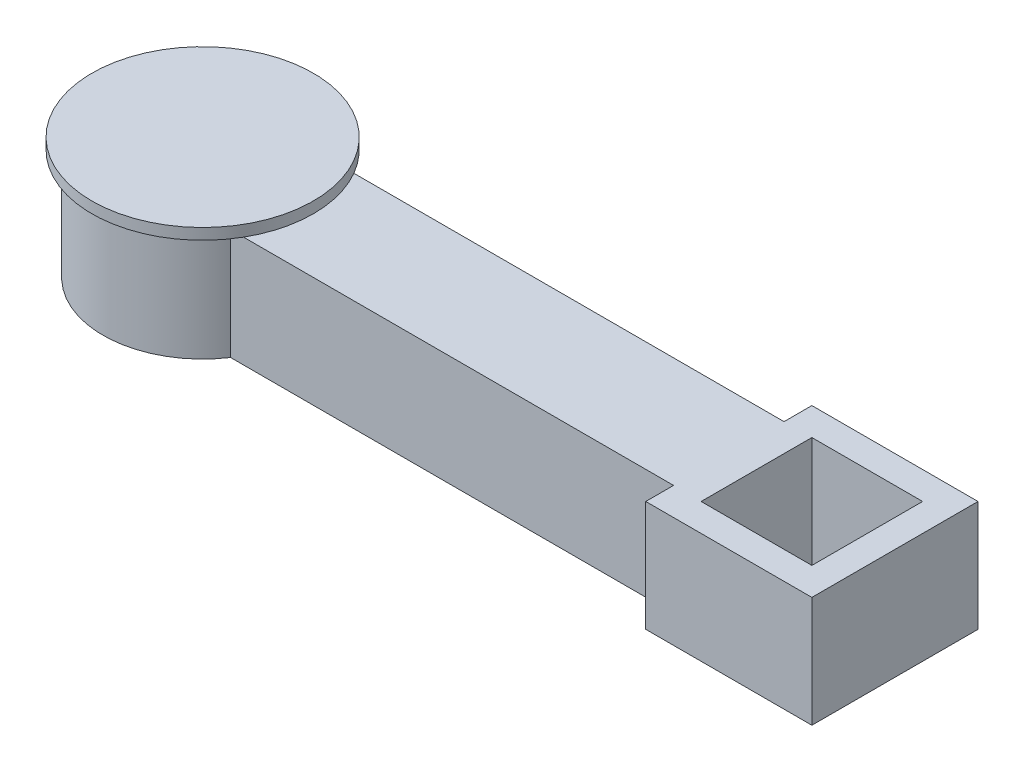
ISO-10303-21;
HEADER;
FILE_DESCRIPTION(('STEP AP214'),'2;1');
FILE_NAME('part.step','',(''),(''),'','','');
FILE_SCHEMA(('AUTOMOTIVE_DESIGN { 1 0 10303 214 1 1 1 1 }'));
ENDSEC;
DATA;
#1=APPLICATION_CONTEXT('core data for automotive mechanical design processes');
#2=APPLICATION_PROTOCOL_DEFINITION('international standard','automotive_design',2000,#1);
#3=PRODUCT_CONTEXT('',#1,'mechanical');
#4=PRODUCT('Part','Part','',(#3));
#5=PRODUCT_RELATED_PRODUCT_CATEGORY('part','',(#4));
#6=PRODUCT_DEFINITION_FORMATION('','',#4);
#7=PRODUCT_DEFINITION_CONTEXT('part definition',#1,'design');
#8=PRODUCT_DEFINITION('design','',#6,#7);
#9=PRODUCT_DEFINITION_SHAPE('','',#8);
#10=(LENGTH_UNIT() NAMED_UNIT(*) SI_UNIT(.MILLI.,.METRE.));
#11=(NAMED_UNIT(*) PLANE_ANGLE_UNIT() SI_UNIT($,.RADIAN.));
#12=(NAMED_UNIT(*) SI_UNIT($,.STERADIAN.) SOLID_ANGLE_UNIT());
#13=UNCERTAINTY_MEASURE_WITH_UNIT(LENGTH_MEASURE(1.E-05),#10,'distance_accuracy_value','');
#14=(GEOMETRIC_REPRESENTATION_CONTEXT(3) GLOBAL_UNCERTAINTY_ASSIGNED_CONTEXT((#13)) GLOBAL_UNIT_ASSIGNED_CONTEXT((#10,
#11,#12)) REPRESENTATION_CONTEXT('',''));
#15=CARTESIAN_POINT('',(0.,0.,0.));
#16=DIRECTION('',(0.,0.,1.));
#17=DIRECTION('',(1.,0.,0.));
#18=AXIS2_PLACEMENT_3D('',#15,#16,#17);
#19=CARTESIAN_POINT('',(163.145565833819,100.,-1.80674005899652E-11));
#20=DIRECTION('',(-1.,0.,1.10744049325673E-13));
#21=DIRECTION('',(1.10744049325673E-13,0.,1.));
#22=AXIS2_PLACEMENT_3D('',#19,#20,#21);
#23=PLANE('',#22);
#24=DIRECTION('',(-1.10744049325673E-13,0.,-1.));
#25=VECTOR('',#24,1.);
#26=CARTESIAN_POINT('',(163.145565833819,0.,-1.80674005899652E-11));
#27=LINE('',#26,#25);
#28=CARTESIAN_POINT('',(163.145565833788,0.,-275.741810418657));
#29=VERTEX_POINT('',#28);
#30=CARTESIAN_POINT('',(163.145565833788,0.,-275.992438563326));
#31=VERTEX_POINT('',#30);
#32=EDGE_CURVE('E235',#29,#31,#27,.T.);
#33=ORIENTED_EDGE('',*,*,#32,.F.);
#34=DIRECTION('',(0.,-1.,0.));
#35=VECTOR('',#34,1.);
#36=CARTESIAN_POINT('',(163.145565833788,100.,-275.741810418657));
#37=LINE('',#36,#35);
#38=CARTESIAN_POINT('',(163.145565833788,100.,-275.741810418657));
#39=VERTEX_POINT('',#38);
#40=EDGE_CURVE('E12',#39,#29,#37,.T.);
#41=ORIENTED_EDGE('',*,*,#40,.F.);
#42=DIRECTION('',(-1.10744049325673E-13,0.,-1.));
#43=VECTOR('',#42,1.);
#44=CARTESIAN_POINT('',(163.145565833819,100.,-1.80674005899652E-11));
#45=LINE('',#44,#43);
#46=CARTESIAN_POINT('',(163.145565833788,100.,-275.992438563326));
#47=VERTEX_POINT('',#46);
#48=EDGE_CURVE('E220',#39,#47,#45,.T.);
#49=ORIENTED_EDGE('',*,*,#48,.T.);
#50=DIRECTION('',(0.,-1.,0.));
#51=VECTOR('',#50,1.);
#52=CARTESIAN_POINT('',(163.145565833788,100.,-275.992438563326));
#53=LINE('',#52,#51);
#54=EDGE_CURVE('E234',#47,#31,#53,.T.);
#55=ORIENTED_EDGE('',*,*,#54,.T.);
#56=EDGE_LOOP('',(#33,#41,#49,#55));
#57=FACE_BOUND('',#56,.T.);
#58=ADVANCED_FACE('F68',(#57),#23,.T.);
#59=CARTESIAN_POINT('',(88.145565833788,100.,-225.992438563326));
#60=DIRECTION('',(0.,-1.,0.));
#61=DIRECTION('',(0.,0.,-1.));
#62=AXIS2_PLACEMENT_3D('',#59,#60,#61);
#63=CYLINDRICAL_SURFACE('',#62,90.);
#64=CARTESIAN_POINT('',(88.145565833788,0.,-225.992438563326));
#65=DIRECTION('',(0.,1.,0.));
#66=DIRECTION('',(0.,0.,1.));
#67=AXIS2_PLACEMENT_3D('',#64,#65,#66);
#68=CIRCLE('',#67,90.);
#69=CARTESIAN_POINT('',(163.145565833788,0.,-176.243066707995));
#70=VERTEX_POINT('',#69);
#71=EDGE_CURVE('E238',#29,#70,#68,.T.);
#72=ORIENTED_EDGE('',*,*,#71,.T.);
#73=DIRECTION('',(0.,-1.,0.));
#74=VECTOR('',#73,1.);
#75=CARTESIAN_POINT('',(163.145565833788,100.,-176.243066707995));
#76=LINE('',#75,#74);
#77=CARTESIAN_POINT('',(163.145565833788,100.,-176.243066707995));
#78=VERTEX_POINT('',#77);
#79=EDGE_CURVE('E77',#78,#70,#76,.T.);
#80=ORIENTED_EDGE('',*,*,#79,.F.);
#81=CARTESIAN_POINT('',(88.145565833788,100.,-225.992438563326));
#82=DIRECTION('',(0.,1.,0.));
#83=DIRECTION('',(0.,0.,1.));
#84=AXIS2_PLACEMENT_3D('',#81,#82,#83);
#85=CIRCLE('',#84,90.);
#86=EDGE_CURVE('E223',#39,#78,#85,.T.);
#87=ORIENTED_EDGE('',*,*,#86,.F.);
#88=ORIENTED_EDGE('',*,*,#40,.T.);
#89=EDGE_LOOP('',(#72,#80,#87,#88));
#90=FACE_BOUND('',#89,.T.);
#91=ADVANCED_FACE('F316',(#90),#63,.T.);
#92=CARTESIAN_POINT('',(0.,100.,-176.243066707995));
#93=DIRECTION('',(0.,0.,-1.));
#94=DIRECTION('',(-1.,0.,0.));
#95=AXIS2_PLACEMENT_3D('',#92,#93,#94);
#96=PLANE('',#95);
#97=DIRECTION('',(1.,0.,0.));
#98=VECTOR('',#97,1.);
#99=CARTESIAN_POINT('',(0.,0.,-176.243066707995));
#100=LINE('',#99,#98);
#101=CARTESIAN_POINT('',(563.145565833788,0.,-176.243066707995));
#102=VERTEX_POINT('',#101);
#103=EDGE_CURVE('E240',#70,#102,#100,.T.);
#104=ORIENTED_EDGE('',*,*,#103,.T.);
#105=DIRECTION('',(0.,-1.,0.));
#106=VECTOR('',#105,1.);
#107=CARTESIAN_POINT('',(563.145565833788,100.,-176.243066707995));
#108=LINE('',#107,#106);
#109=CARTESIAN_POINT('',(563.145565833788,100.,-176.243066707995));
#110=VERTEX_POINT('',#109);
#111=EDGE_CURVE('E248',#110,#102,#108,.T.);
#112=ORIENTED_EDGE('',*,*,#111,.F.);
#113=DIRECTION('',(1.,0.,0.));
#114=VECTOR('',#113,1.);
#115=CARTESIAN_POINT('',(0.,100.,-176.243066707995));
#116=LINE('',#115,#114);
#117=CARTESIAN_POINT('',(174.892323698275,100.,-176.243066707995));
#118=VERTEX_POINT('',#117);
#119=EDGE_CURVE('E227',#118,#110,#116,.T.);
#120=ORIENTED_EDGE('',*,*,#119,.F.);
#121=EDGE_CURVE('E228',#78,#118,#116,.T.);
#122=ORIENTED_EDGE('',*,*,#121,.F.);
#123=ORIENTED_EDGE('',*,*,#79,.T.);
#124=EDGE_LOOP('',(#104,#112,#120,#122,#123));
#125=FACE_BOUND('',#124,.T.);
#126=ADVANCED_FACE('F312',(#125),#96,.F.);
#127=CARTESIAN_POINT('',(0.,100.,-275.992438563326));
#128=DIRECTION('',(0.,0.,-1.));
#129=DIRECTION('',(-1.,0.,0.));
#130=AXIS2_PLACEMENT_3D('',#127,#128,#129);
#131=PLANE('',#130);
#132=DIRECTION('',(1.,0.,0.));
#133=VECTOR('',#132,1.);
#134=CARTESIAN_POINT('',(0.,0.,-275.992438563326));
#135=LINE('',#134,#133);
#136=CARTESIAN_POINT('',(563.145565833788,0.,-275.992438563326));
#137=VERTEX_POINT('',#136);
#138=EDGE_CURVE('E224',#31,#137,#135,.T.);
#139=ORIENTED_EDGE('',*,*,#138,.F.);
#140=ORIENTED_EDGE('',*,*,#54,.F.);
#141=DIRECTION('',(1.,0.,0.));
#142=VECTOR('',#141,1.);
#143=CARTESIAN_POINT('',(0.,100.,-275.992438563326));
#144=LINE('',#143,#142);
#145=CARTESIAN_POINT('',(174.748106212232,100.,-275.992438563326));
#146=VERTEX_POINT('',#145);
#147=EDGE_CURVE('E232',#47,#146,#144,.T.);
#148=ORIENTED_EDGE('',*,*,#147,.T.);
#149=CARTESIAN_POINT('',(563.145565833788,100.,-275.992438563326));
#150=VERTEX_POINT('',#149);
#151=EDGE_CURVE('E231',#146,#150,#144,.T.);
#152=ORIENTED_EDGE('',*,*,#151,.T.);
#153=DIRECTION('',(0.,-1.,0.));
#154=VECTOR('',#153,1.);
#155=CARTESIAN_POINT('',(563.145565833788,100.,-275.992438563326));
#156=LINE('',#155,#154);
#157=EDGE_CURVE('E246',#150,#137,#156,.T.);
#158=ORIENTED_EDGE('',*,*,#157,.T.);
#159=EDGE_LOOP('',(#139,#140,#148,#152,#158));
#160=FACE_BOUND('',#159,.T.);
#161=ADVANCED_FACE('F323',(#160),#131,.T.);
#162=CARTESIAN_POINT('',(0.,100.,0.));
#163=DIRECTION('',(0.,1.,0.));
#164=DIRECTION('',(0.,0.,1.));
#165=AXIS2_PLACEMENT_3D('',#162,#163,#164);
#166=PLANE('',#165);
#167=DIRECTION('',(0.,0.,1.));
#168=VECTOR('',#167,1.);
#169=CARTESIAN_POINT('',(588.145565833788,100.,-176.117752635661));
#170=LINE('',#169,#168);
#171=CARTESIAN_POINT('',(588.145565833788,100.,-276.117752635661));
#172=VERTEX_POINT('',#171);
#173=CARTESIAN_POINT('',(588.145565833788,100.,-176.117752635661));
#174=VERTEX_POINT('',#173);
#175=EDGE_CURVE('E85',#172,#174,#170,.T.);
#176=ORIENTED_EDGE('',*,*,#175,.F.);
#177=DIRECTION('',(-1.,0.,0.));
#178=VECTOR('',#177,1.);
#179=CARTESIAN_POINT('',(588.145565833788,100.,-276.117752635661));
#180=LINE('',#179,#178);
#181=CARTESIAN_POINT('',(688.145565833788,100.,-276.117752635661));
#182=VERTEX_POINT('',#181);
#183=EDGE_CURVE('E188',#182,#172,#180,.T.);
#184=ORIENTED_EDGE('',*,*,#183,.F.);
#185=DIRECTION('',(0.,0.,-1.));
#186=VECTOR('',#185,1.);
#187=CARTESIAN_POINT('',(688.145565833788,100.,-176.117752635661));
#188=LINE('',#187,#186);
#189=CARTESIAN_POINT('',(688.145565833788,100.,-176.117752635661));
#190=VERTEX_POINT('',#189);
#191=EDGE_CURVE('E191',#190,#182,#188,.T.);
#192=ORIENTED_EDGE('',*,*,#191,.F.);
#193=DIRECTION('',(1.,0.,0.));
#194=VECTOR('',#193,1.);
#195=CARTESIAN_POINT('',(588.145565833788,100.,-176.117752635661));
#196=LINE('',#195,#194);
#197=EDGE_CURVE('E197',#174,#190,#196,.T.);
#198=ORIENTED_EDGE('',*,*,#197,.F.);
#199=EDGE_LOOP('',(#176,#184,#192,#198));
#200=FACE_BOUND('',#199,.T.);
#201=CARTESIAN_POINT('',(88.145565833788,100.,-225.992438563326));
#202=DIRECTION('',(0.,1.,0.));
#203=DIRECTION('',(0.,0.,1.));
#204=AXIS2_PLACEMENT_3D('',#201,#202,#203);
#205=CIRCLE('',#204,100.);
#206=EDGE_CURVE('E211',#118,#146,#205,.T.);
#207=ORIENTED_EDGE('',*,*,#206,.F.);
#208=ORIENTED_EDGE('',*,*,#119,.T.);
#209=DIRECTION('',(0.,0.,1.));
#210=VECTOR('',#209,1.);
#211=CARTESIAN_POINT('',(563.145565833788,100.,-301.117752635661));
#212=LINE('',#211,#210);
#213=CARTESIAN_POINT('',(563.145565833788,100.,-151.117752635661));
#214=VERTEX_POINT('',#213);
#215=EDGE_CURVE('E261',#110,#214,#212,.T.);
#216=ORIENTED_EDGE('',*,*,#215,.T.);
#217=DIRECTION('',(1.,0.,0.));
#218=VECTOR('',#217,1.);
#219=CARTESIAN_POINT('',(563.145565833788,100.,-151.117752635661));
#220=LINE('',#219,#218);
#221=CARTESIAN_POINT('',(713.145565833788,100.,-151.117752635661));
#222=VERTEX_POINT('',#221);
#223=EDGE_CURVE('E252',#214,#222,#220,.T.);
#224=ORIENTED_EDGE('',*,*,#223,.T.);
#225=DIRECTION('',(0.,0.,1.));
#226=VECTOR('',#225,1.);
#227=CARTESIAN_POINT('',(713.145565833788,100.,-301.117752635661));
#228=LINE('',#227,#226);
#229=CARTESIAN_POINT('',(713.145565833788,100.,-301.117752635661));
#230=VERTEX_POINT('',#229);
#231=EDGE_CURVE('E254',#230,#222,#228,.T.);
#232=ORIENTED_EDGE('',*,*,#231,.F.);
#233=DIRECTION('',(1.,0.,0.));
#234=VECTOR('',#233,1.);
#235=CARTESIAN_POINT('',(563.145565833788,100.,-301.117752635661));
#236=LINE('',#235,#234);
#237=CARTESIAN_POINT('',(563.145565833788,100.,-301.117752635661));
#238=VERTEX_POINT('',#237);
#239=EDGE_CURVE('E258',#238,#230,#236,.T.);
#240=ORIENTED_EDGE('',*,*,#239,.F.);
#241=EDGE_CURVE('E262',#238,#150,#212,.T.);
#242=ORIENTED_EDGE('',*,*,#241,.T.);
#243=ORIENTED_EDGE('',*,*,#151,.F.);
#244=EDGE_LOOP('',(#207,#208,#216,#224,#232,#240,#242,#243));
#245=FACE_BOUND('',#244,.T.);
#246=ADVANCED_FACE('F303',(#200,#245),#166,.T.);
#247=CARTESIAN_POINT('',(0.,0.,0.));
#248=DIRECTION('',(0.,1.,0.));
#249=DIRECTION('',(0.,0.,1.));
#250=AXIS2_PLACEMENT_3D('',#247,#248,#249);
#251=PLANE('',#250);
#252=DIRECTION('',(-1.,0.,0.));
#253=VECTOR('',#252,1.);
#254=CARTESIAN_POINT('',(588.145565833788,0.,-276.117752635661));
#255=LINE('',#254,#253);
#256=CARTESIAN_POINT('',(688.145565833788,0.,-276.117752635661));
#257=VERTEX_POINT('',#256);
#258=CARTESIAN_POINT('',(588.145565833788,0.,-276.117752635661));
#259=VERTEX_POINT('',#258);
#260=EDGE_CURVE('E178',#257,#259,#255,.T.);
#261=ORIENTED_EDGE('',*,*,#260,.T.);
#262=DIRECTION('',(0.,0.,1.));
#263=VECTOR('',#262,1.);
#264=CARTESIAN_POINT('',(588.145565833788,0.,-176.117752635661));
#265=LINE('',#264,#263);
#266=CARTESIAN_POINT('',(588.145565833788,0.,-176.117752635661));
#267=VERTEX_POINT('',#266);
#268=EDGE_CURVE('E172',#259,#267,#265,.T.);
#269=ORIENTED_EDGE('',*,*,#268,.T.);
#270=DIRECTION('',(1.,0.,0.));
#271=VECTOR('',#270,1.);
#272=CARTESIAN_POINT('',(588.145565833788,0.,-176.117752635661));
#273=LINE('',#272,#271);
#274=CARTESIAN_POINT('',(688.145565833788,0.,-176.117752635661));
#275=VERTEX_POINT('',#274);
#276=EDGE_CURVE('E181',#267,#275,#273,.T.);
#277=ORIENTED_EDGE('',*,*,#276,.T.);
#278=DIRECTION('',(0.,0.,-1.));
#279=VECTOR('',#278,1.);
#280=CARTESIAN_POINT('',(688.145565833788,0.,-176.117752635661));
#281=LINE('',#280,#279);
#282=EDGE_CURVE('E93',#275,#257,#281,.T.);
#283=ORIENTED_EDGE('',*,*,#282,.T.);
#284=EDGE_LOOP('',(#261,#269,#277,#283));
#285=FACE_BOUND('',#284,.T.);
#286=CARTESIAN_POINT('',(88.145565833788,0.,-225.992438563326));
#287=DIRECTION('',(0.,1.,0.));
#288=DIRECTION('',(0.,0.,1.));
#289=AXIS2_PLACEMENT_3D('',#286,#287,#288);
#290=CIRCLE('',#289,70.);
#291=CARTESIAN_POINT('',(88.145565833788,0.,-155.992438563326));
#292=VERTEX_POINT('',#291);
#293=EDGE_CURVE('E214',#292,#292,#290,.T.);
#294=ORIENTED_EDGE('',*,*,#293,.T.);
#295=EDGE_LOOP('',(#294));
#296=FACE_BOUND('',#295,.T.);
#297=ORIENTED_EDGE('',*,*,#32,.T.);
#298=ORIENTED_EDGE('',*,*,#138,.T.);
#299=DIRECTION('',(0.,0.,1.));
#300=VECTOR('',#299,1.);
#301=CARTESIAN_POINT('',(563.145565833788,0.,-301.117752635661));
#302=LINE('',#301,#300);
#303=CARTESIAN_POINT('',(563.145565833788,0.,-301.117752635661));
#304=VERTEX_POINT('',#303);
#305=EDGE_CURVE('E255',#304,#137,#302,.T.);
#306=ORIENTED_EDGE('',*,*,#305,.F.);
#307=DIRECTION('',(1.,0.,0.));
#308=VECTOR('',#307,1.);
#309=CARTESIAN_POINT('',(563.145565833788,0.,-301.117752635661));
#310=LINE('',#309,#308);
#311=CARTESIAN_POINT('',(713.145565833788,0.,-301.117752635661));
#312=VERTEX_POINT('',#311);
#313=EDGE_CURVE('E271',#304,#312,#310,.T.);
#314=ORIENTED_EDGE('',*,*,#313,.T.);
#315=DIRECTION('',(0.,0.,1.));
#316=VECTOR('',#315,1.);
#317=CARTESIAN_POINT('',(713.145565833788,0.,-301.117752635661));
#318=LINE('',#317,#316);
#319=CARTESIAN_POINT('',(713.145565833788,0.,-151.117752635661));
#320=VERTEX_POINT('',#319);
#321=EDGE_CURVE('E268',#312,#320,#318,.T.);
#322=ORIENTED_EDGE('',*,*,#321,.T.);
#323=DIRECTION('',(1.,0.,0.));
#324=VECTOR('',#323,1.);
#325=CARTESIAN_POINT('',(563.145565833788,0.,-151.117752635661));
#326=LINE('',#325,#324);
#327=CARTESIAN_POINT('',(563.145565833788,0.,-151.117752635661));
#328=VERTEX_POINT('',#327);
#329=EDGE_CURVE('E217',#328,#320,#326,.T.);
#330=ORIENTED_EDGE('',*,*,#329,.F.);
#331=EDGE_CURVE('E274',#102,#328,#302,.T.);
#332=ORIENTED_EDGE('',*,*,#331,.F.);
#333=ORIENTED_EDGE('',*,*,#103,.F.);
#334=ORIENTED_EDGE('',*,*,#71,.F.);
#335=EDGE_LOOP('',(#297,#298,#306,#314,#322,#330,#332,#333,#334));
#336=FACE_BOUND('',#335,.T.);
#337=ADVANCED_FACE('F185',(#285,#296,#336),#251,.F.);
#338=CARTESIAN_POINT('',(713.145565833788,100.,-301.117752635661));
#339=DIRECTION('',(1.,0.,0.));
#340=DIRECTION('',(0.,0.,-1.));
#341=AXIS2_PLACEMENT_3D('',#338,#339,#340);
#342=PLANE('',#341);
#343=ORIENTED_EDGE('',*,*,#321,.F.);
#344=DIRECTION('',(0.,-1.,0.));
#345=VECTOR('',#344,1.);
#346=CARTESIAN_POINT('',(713.145565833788,100.,-301.117752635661));
#347=LINE('',#346,#345);
#348=EDGE_CURVE('E280',#230,#312,#347,.T.);
#349=ORIENTED_EDGE('',*,*,#348,.F.);
#350=ORIENTED_EDGE('',*,*,#231,.T.);
#351=DIRECTION('',(0.,-1.,0.));
#352=VECTOR('',#351,1.);
#353=CARTESIAN_POINT('',(713.145565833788,100.,-151.117752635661));
#354=LINE('',#353,#352);
#355=EDGE_CURVE('E72',#222,#320,#354,.T.);
#356=ORIENTED_EDGE('',*,*,#355,.T.);
#357=EDGE_LOOP('',(#343,#349,#350,#356));
#358=FACE_BOUND('',#357,.T.);
#359=ADVANCED_FACE('F286',(#358),#342,.T.);
#360=CARTESIAN_POINT('',(563.145565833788,100.,-301.117752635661));
#361=DIRECTION('',(0.,0.,-1.));
#362=DIRECTION('',(-1.,0.,0.));
#363=AXIS2_PLACEMENT_3D('',#360,#361,#362);
#364=PLANE('',#363);
#365=ORIENTED_EDGE('',*,*,#313,.F.);
#366=DIRECTION('',(0.,-1.,0.));
#367=VECTOR('',#366,1.);
#368=CARTESIAN_POINT('',(563.145565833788,100.,-301.117752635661));
#369=LINE('',#368,#367);
#370=EDGE_CURVE('E279',#238,#304,#369,.T.);
#371=ORIENTED_EDGE('',*,*,#370,.F.);
#372=ORIENTED_EDGE('',*,*,#239,.T.);
#373=ORIENTED_EDGE('',*,*,#348,.T.);
#374=EDGE_LOOP('',(#365,#371,#372,#373));
#375=FACE_BOUND('',#374,.T.);
#376=ADVANCED_FACE('F295',(#375),#364,.T.);
#377=CARTESIAN_POINT('',(563.145565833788,100.,-151.117752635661));
#378=DIRECTION('',(0.,0.,-1.));
#379=DIRECTION('',(-1.,0.,0.));
#380=AXIS2_PLACEMENT_3D('',#377,#378,#379);
#381=PLANE('',#380);
#382=ORIENTED_EDGE('',*,*,#329,.T.);
#383=ORIENTED_EDGE('',*,*,#355,.F.);
#384=ORIENTED_EDGE('',*,*,#223,.F.);
#385=DIRECTION('',(0.,-1.,0.));
#386=VECTOR('',#385,1.);
#387=CARTESIAN_POINT('',(563.145565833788,100.,-151.117752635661));
#388=LINE('',#387,#386);
#389=EDGE_CURVE('E265',#214,#328,#388,.T.);
#390=ORIENTED_EDGE('',*,*,#389,.T.);
#391=EDGE_LOOP('',(#382,#383,#384,#390));
#392=FACE_BOUND('',#391,.T.);
#393=ADVANCED_FACE('F70',(#392),#381,.F.);
#394=CARTESIAN_POINT('',(563.145565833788,100.,-301.117752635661));
#395=DIRECTION('',(1.,0.,0.));
#396=DIRECTION('',(0.,0.,-1.));
#397=AXIS2_PLACEMENT_3D('',#394,#395,#396);
#398=PLANE('',#397);
#399=ORIENTED_EDGE('',*,*,#215,.F.);
#400=ORIENTED_EDGE('',*,*,#111,.T.);
#401=ORIENTED_EDGE('',*,*,#331,.T.);
#402=ORIENTED_EDGE('',*,*,#389,.F.);
#403=EDGE_LOOP('',(#399,#400,#401,#402));
#404=FACE_BOUND('',#403,.T.);
#405=ADVANCED_FACE('F308',(#404),#398,.F.);
#406=ORIENTED_EDGE('',*,*,#157,.F.);
#407=ORIENTED_EDGE('',*,*,#241,.F.);
#408=ORIENTED_EDGE('',*,*,#370,.T.);
#409=ORIENTED_EDGE('',*,*,#305,.T.);
#410=EDGE_LOOP('',(#406,#407,#408,#409));
#411=FACE_BOUND('',#410,.T.);
#412=ADVANCED_FACE('F300',(#411),#398,.F.);
#413=CARTESIAN_POINT('',(88.145565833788,0.,-225.992438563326));
#414=DIRECTION('',(0.,1.,0.));
#415=DIRECTION('',(0.,0.,1.));
#416=AXIS2_PLACEMENT_3D('',#413,#414,#415);
#417=CYLINDRICAL_SURFACE('',#416,70.);
#418=ORIENTED_EDGE('',*,*,#293,.F.);
#419=EDGE_LOOP('',(#418));
#420=FACE_BOUND('',#419,.T.);
#421=CARTESIAN_POINT('',(88.145565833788,100.,-225.992438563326));
#422=DIRECTION('',(0.,1.,0.));
#423=DIRECTION('',(0.,0.,1.));
#424=AXIS2_PLACEMENT_3D('',#421,#422,#423);
#425=CIRCLE('',#424,70.);
#426=CARTESIAN_POINT('',(88.145565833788,100.,-155.992438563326));
#427=VERTEX_POINT('',#426);
#428=EDGE_CURVE('E210',#427,#427,#425,.T.);
#429=ORIENTED_EDGE('',*,*,#428,.T.);
#430=EDGE_LOOP('',(#429));
#431=FACE_BOUND('',#430,.T.);
#432=ADVANCED_FACE('F340',(#420,#431),#417,.F.);
#433=CARTESIAN_POINT('',(88.145565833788,110.,-225.992438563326));
#434=DIRECTION('',(0.,1.,0.));
#435=DIRECTION('',(0.,0.,1.));
#436=AXIS2_PLACEMENT_3D('',#433,#434,#435);
#437=PLANE('',#436);
#438=CARTESIAN_POINT('',(88.145565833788,110.,-225.992438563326));
#439=DIRECTION('',(0.,1.,0.));
#440=DIRECTION('',(0.,0.,1.));
#441=AXIS2_PLACEMENT_3D('',#438,#439,#440);
#442=CIRCLE('',#441,100.);
#443=CARTESIAN_POINT('',(88.145565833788,110.,-125.992438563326));
#444=VERTEX_POINT('',#443);
#445=EDGE_CURVE('E207',#444,#444,#442,.T.);
#446=ORIENTED_EDGE('',*,*,#445,.T.);
#447=EDGE_LOOP('',(#446));
#448=FACE_BOUND('',#447,.T.);
#449=ADVANCED_FACE('F331',(#448),#437,.T.);
#450=CARTESIAN_POINT('',(88.145565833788,110.,-225.992438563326));
#451=DIRECTION('',(0.,-1.,0.));
#452=DIRECTION('',(0.,0.,-1.));
#453=AXIS2_PLACEMENT_3D('',#450,#451,#452);
#454=CYLINDRICAL_SURFACE('',#453,100.);
#455=ORIENTED_EDGE('',*,*,#445,.F.);
#456=EDGE_LOOP('',(#455));
#457=FACE_BOUND('',#456,.T.);
#458=ORIENTED_EDGE('',*,*,#206,.T.);
#459=EDGE_CURVE('E203',#146,#118,#205,.T.);
#460=ORIENTED_EDGE('',*,*,#459,.T.);
#461=EDGE_LOOP('',(#458,#460));
#462=FACE_BOUND('',#461,.T.);
#463=ADVANCED_FACE('F329',(#457,#462),#454,.T.);
#464=CARTESIAN_POINT('',(88.145565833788,100.,-225.992438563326));
#465=DIRECTION('',(0.,1.,0.));
#466=DIRECTION('',(0.,0.,1.));
#467=AXIS2_PLACEMENT_3D('',#464,#465,#466);
#468=PLANE('',#467);
#469=ORIENTED_EDGE('',*,*,#86,.T.);
#470=ORIENTED_EDGE('',*,*,#121,.T.);
#471=ORIENTED_EDGE('',*,*,#459,.F.);
#472=ORIENTED_EDGE('',*,*,#147,.F.);
#473=ORIENTED_EDGE('',*,*,#48,.F.);
#474=EDGE_LOOP('',(#469,#470,#471,#472,#473));
#475=FACE_BOUND('',#474,.T.);
#476=ADVANCED_FACE('F327',(#475),#468,.F.);
#477=ORIENTED_EDGE('',*,*,#428,.F.);
#478=EDGE_LOOP('',(#477));
#479=FACE_BOUND('',#478,.T.);
#480=ADVANCED_FACE('F338',(#479),#468,.F.);
#481=CARTESIAN_POINT('',(588.145565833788,0.,-176.117752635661));
#482=DIRECTION('',(-1.,0.,0.));
#483=DIRECTION('',(0.,0.,1.));
#484=AXIS2_PLACEMENT_3D('',#481,#482,#483);
#485=PLANE('',#484);
#486=ORIENTED_EDGE('',*,*,#175,.T.);
#487=DIRECTION('',(0.,1.,0.));
#488=VECTOR('',#487,1.);
#489=CARTESIAN_POINT('',(588.145565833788,0.,-176.117752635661));
#490=LINE('',#489,#488);
#491=EDGE_CURVE('E168',#267,#174,#490,.T.);
#492=ORIENTED_EDGE('',*,*,#491,.F.);
#493=ORIENTED_EDGE('',*,*,#268,.F.);
#494=DIRECTION('',(0.,1.,0.));
#495=VECTOR('',#494,1.);
#496=CARTESIAN_POINT('',(588.145565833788,0.,-276.117752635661));
#497=LINE('',#496,#495);
#498=EDGE_CURVE('E201',#259,#172,#497,.T.);
#499=ORIENTED_EDGE('',*,*,#498,.T.);
#500=EDGE_LOOP('',(#486,#492,#493,#499));
#501=FACE_BOUND('',#500,.T.);
#502=ADVANCED_FACE('F170',(#501),#485,.F.);
#503=CARTESIAN_POINT('',(588.145565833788,0.,-276.117752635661));
#504=DIRECTION('',(0.,0.,-1.));
#505=DIRECTION('',(-1.,0.,0.));
#506=AXIS2_PLACEMENT_3D('',#503,#504,#505);
#507=PLANE('',#506);
#508=ORIENTED_EDGE('',*,*,#183,.T.);
#509=ORIENTED_EDGE('',*,*,#498,.F.);
#510=ORIENTED_EDGE('',*,*,#260,.F.);
#511=DIRECTION('',(0.,1.,0.));
#512=VECTOR('',#511,1.);
#513=CARTESIAN_POINT('',(688.145565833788,0.,-276.117752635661));
#514=LINE('',#513,#512);
#515=EDGE_CURVE('E204',#257,#182,#514,.T.);
#516=ORIENTED_EDGE('',*,*,#515,.T.);
#517=EDGE_LOOP('',(#508,#509,#510,#516));
#518=FACE_BOUND('',#517,.T.);
#519=ADVANCED_FACE('F379',(#518),#507,.F.);
#520=CARTESIAN_POINT('',(688.145565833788,0.,-176.117752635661));
#521=DIRECTION('',(1.,0.,0.));
#522=DIRECTION('',(0.,0.,-1.));
#523=AXIS2_PLACEMENT_3D('',#520,#521,#522);
#524=PLANE('',#523);
#525=ORIENTED_EDGE('',*,*,#191,.T.);
#526=ORIENTED_EDGE('',*,*,#515,.F.);
#527=ORIENTED_EDGE('',*,*,#282,.F.);
#528=DIRECTION('',(0.,1.,0.));
#529=VECTOR('',#528,1.);
#530=CARTESIAN_POINT('',(688.145565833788,0.,-176.117752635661));
#531=LINE('',#530,#529);
#532=EDGE_CURVE('E177',#275,#190,#531,.T.);
#533=ORIENTED_EDGE('',*,*,#532,.T.);
#534=EDGE_LOOP('',(#525,#526,#527,#533));
#535=FACE_BOUND('',#534,.T.);
#536=ADVANCED_FACE('F384',(#535),#524,.F.);
#537=CARTESIAN_POINT('',(588.145565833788,0.,-176.117752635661));
#538=DIRECTION('',(0.,0.,1.));
#539=DIRECTION('',(1.,0.,0.));
#540=AXIS2_PLACEMENT_3D('',#537,#538,#539);
#541=PLANE('',#540);
#542=ORIENTED_EDGE('',*,*,#197,.T.);
#543=ORIENTED_EDGE('',*,*,#532,.F.);
#544=ORIENTED_EDGE('',*,*,#276,.F.);
#545=ORIENTED_EDGE('',*,*,#491,.T.);
#546=EDGE_LOOP('',(#542,#543,#544,#545));
#547=FACE_BOUND('',#546,.T.);
#548=ADVANCED_FACE('F182',(#547),#541,.F.);
#549=CLOSED_SHELL('',(#58,#91,#126,#161,#246,#337,#359,#376,#393,#405,#412,#432,#449,#463,#476,
#480,#502,#519,#536,#548));
#550=MANIFOLD_SOLID_BREP('B2',#549);
#551=ADVANCED_BREP_SHAPE_REPRESENTATION('',(#18,#550),#14);
#552=SHAPE_DEFINITION_REPRESENTATION(#9,#551);
ENDSEC;
END-ISO-10303-21;
